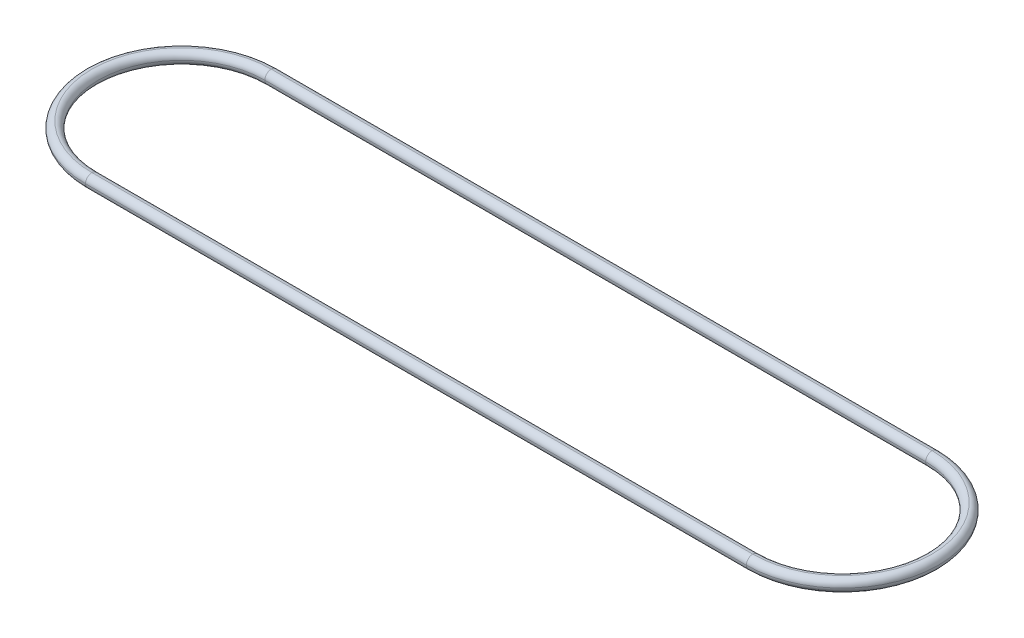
ISO-10303-21;
HEADER;
FILE_DESCRIPTION(('STEP AP214'),'2;1');
FILE_NAME('part.step','',(''),(''),'','','');
FILE_SCHEMA(('AUTOMOTIVE_DESIGN { 1 0 10303 214 1 1 1 1 }'));
ENDSEC;
DATA;
#1=APPLICATION_CONTEXT('core data for automotive mechanical design processes');
#2=APPLICATION_PROTOCOL_DEFINITION('international standard','automotive_design',2000,#1);
#3=PRODUCT_CONTEXT('',#1,'mechanical');
#4=PRODUCT('Part','Part','',(#3));
#5=PRODUCT_RELATED_PRODUCT_CATEGORY('part','',(#4));
#6=PRODUCT_DEFINITION_FORMATION('','',#4);
#7=PRODUCT_DEFINITION_CONTEXT('part definition',#1,'design');
#8=PRODUCT_DEFINITION('design','',#6,#7);
#9=PRODUCT_DEFINITION_SHAPE('','',#8);
#10=(LENGTH_UNIT() NAMED_UNIT(*) SI_UNIT(.MILLI.,.METRE.));
#11=(NAMED_UNIT(*) PLANE_ANGLE_UNIT() SI_UNIT($,.RADIAN.));
#12=(NAMED_UNIT(*) SI_UNIT($,.STERADIAN.) SOLID_ANGLE_UNIT());
#13=UNCERTAINTY_MEASURE_WITH_UNIT(LENGTH_MEASURE(1.E-05),#10,'distance_accuracy_value','');
#14=(GEOMETRIC_REPRESENTATION_CONTEXT(3) GLOBAL_UNCERTAINTY_ASSIGNED_CONTEXT((#13)) GLOBAL_UNIT_ASSIGNED_CONTEXT((#10,
#11,#12)) REPRESENTATION_CONTEXT('',''));
#15=CARTESIAN_POINT('',(0.,0.,0.));
#16=DIRECTION('',(0.,0.,1.));
#17=DIRECTION('',(1.,0.,0.));
#18=AXIS2_PLACEMENT_3D('',#15,#16,#17);
#19=CARTESIAN_POINT('',(0.,2.5,-35.));
#20=DIRECTION('',(1.,0.,0.));
#21=DIRECTION('',(0.,0.,-1.));
#22=AXIS2_PLACEMENT_3D('',#19,#20,#21);
#23=CYLINDRICAL_SURFACE('',#22,2.5);
#24=CARTESIAN_POINT('',(0.,2.5,-35.));
#25=DIRECTION('',(-1.,0.,0.));
#26=DIRECTION('',(0.,0.,1.));
#27=AXIS2_PLACEMENT_3D('',#24,#25,#26);
#28=CIRCLE('',#27,2.5);
#29=CARTESIAN_POINT('',(0.,5.,-35.));
#30=VERTEX_POINT('',#29);
#31=CARTESIAN_POINT('',(0.,2.5,-37.5));
#32=VERTEX_POINT('',#31);
#33=EDGE_CURVE('E11',#30,#32,#28,.T.);
#34=ORIENTED_EDGE('',*,*,#33,.F.);
#35=DIRECTION('',(-1.,0.,0.));
#36=VECTOR('',#35,1.);
#37=CARTESIAN_POINT('',(0.,5.,-35.));
#38=LINE('',#37,#36);
#39=CARTESIAN_POINT('',(258.,5.,-35.));
#40=VERTEX_POINT('',#39);
#41=EDGE_CURVE('E185',#40,#30,#38,.T.);
#42=ORIENTED_EDGE('',*,*,#41,.F.);
#43=CARTESIAN_POINT('',(258.,2.5,-35.));
#44=DIRECTION('',(1.,0.,0.));
#45=DIRECTION('',(0.,0.,-1.));
#46=AXIS2_PLACEMENT_3D('',#43,#44,#45);
#47=CIRCLE('',#46,2.5);
#48=CARTESIAN_POINT('',(258.,2.5,-37.5));
#49=VERTEX_POINT('',#48);
#50=EDGE_CURVE('E182',#49,#40,#47,.T.);
#51=ORIENTED_EDGE('',*,*,#50,.F.);
#52=DIRECTION('',(-1.,0.,0.));
#53=VECTOR('',#52,1.);
#54=CARTESIAN_POINT('',(258.,2.5,-37.5));
#55=LINE('',#54,#53);
#56=EDGE_CURVE('E34',#32,#49,#55,.F.);
#57=ORIENTED_EDGE('',*,*,#56,.F.);
#58=EDGE_LOOP('',(#34,#42,#51,#57));
#59=FACE_BOUND('',#58,.T.);
#60=ADVANCED_FACE('F27',(#59),#23,.T.);
#61=CARTESIAN_POINT('',(0.,2.5,0.));
#62=DIRECTION('',(0.,1.,0.));
#63=DIRECTION('',(0.,0.,1.));
#64=AXIS2_PLACEMENT_3D('',#61,#62,#63);
#65=TOROIDAL_SURFACE('',#64,35.,2.5);
#66=CARTESIAN_POINT('',(0.,5.,0.));
#67=DIRECTION('',(0.,1.,0.));
#68=DIRECTION('',(0.,0.,1.));
#69=AXIS2_PLACEMENT_3D('',#66,#67,#68);
#70=CIRCLE('',#69,35.);
#71=CARTESIAN_POINT('',(0.,5.,35.));
#72=VERTEX_POINT('',#71);
#73=EDGE_CURVE('E180',#30,#72,#70,.T.);
#74=ORIENTED_EDGE('',*,*,#73,.F.);
#75=ORIENTED_EDGE('',*,*,#33,.T.);
#76=CARTESIAN_POINT('',(0.,2.5,0.));
#77=DIRECTION('',(0.,1.,0.));
#78=DIRECTION('',(0.,0.,1.));
#79=AXIS2_PLACEMENT_3D('',#76,#77,#78);
#80=CIRCLE('',#79,37.5);
#81=CARTESIAN_POINT('',(0.,2.5,37.5));
#82=VERTEX_POINT('',#81);
#83=EDGE_CURVE('E172',#82,#32,#80,.F.);
#84=ORIENTED_EDGE('',*,*,#83,.F.);
#85=CARTESIAN_POINT('',(0.,2.5,35.));
#86=DIRECTION('',(1.,0.,0.));
#87=DIRECTION('',(0.,0.,-1.));
#88=AXIS2_PLACEMENT_3D('',#85,#86,#87);
#89=CIRCLE('',#88,2.5);
#90=EDGE_CURVE('E169',#72,#82,#89,.T.);
#91=ORIENTED_EDGE('',*,*,#90,.F.);
#92=EDGE_LOOP('',(#74,#75,#84,#91));
#93=FACE_BOUND('',#92,.T.);
#94=ADVANCED_FACE('F217',(#93),#65,.T.);
#95=CARTESIAN_POINT('',(0.,2.5,-35.));
#96=DIRECTION('',(-1.,0.,0.));
#97=DIRECTION('',(0.,0.,1.));
#98=AXIS2_PLACEMENT_3D('',#95,#96,#97);
#99=CYLINDRICAL_SURFACE('',#98,2.5);
#100=CARTESIAN_POINT('',(0.,2.5,-35.));
#101=DIRECTION('',(-1.,0.,0.));
#102=DIRECTION('',(0.,0.,1.));
#103=AXIS2_PLACEMENT_3D('',#100,#101,#102);
#104=CIRCLE('',#103,2.5);
#105=CARTESIAN_POINT('',(0.,0.,-35.));
#106=VERTEX_POINT('',#105);
#107=EDGE_CURVE('E175',#32,#106,#104,.T.);
#108=ORIENTED_EDGE('',*,*,#107,.F.);
#109=ORIENTED_EDGE('',*,*,#56,.T.);
#110=CARTESIAN_POINT('',(258.,2.5,-35.));
#111=DIRECTION('',(1.,0.,0.));
#112=DIRECTION('',(0.,0.,-1.));
#113=AXIS2_PLACEMENT_3D('',#110,#111,#112);
#114=CIRCLE('',#113,2.5);
#115=CARTESIAN_POINT('',(258.,0.,-35.));
#116=VERTEX_POINT('',#115);
#117=EDGE_CURVE('E164',#116,#49,#114,.T.);
#118=ORIENTED_EDGE('',*,*,#117,.F.);
#119=DIRECTION('',(-1.,0.,0.));
#120=VECTOR('',#119,1.);
#121=CARTESIAN_POINT('',(0.,0.,-35.));
#122=LINE('',#121,#120);
#123=EDGE_CURVE('E161',#106,#116,#122,.F.);
#124=ORIENTED_EDGE('',*,*,#123,.F.);
#125=EDGE_LOOP('',(#108,#109,#118,#124));
#126=FACE_BOUND('',#125,.T.);
#127=ADVANCED_FACE('F189',(#126),#99,.T.);
#128=CARTESIAN_POINT('',(0.,2.5,-35.));
#129=DIRECTION('',(-1.,0.,0.));
#130=DIRECTION('',(0.,0.,1.));
#131=AXIS2_PLACEMENT_3D('',#128,#129,#130);
#132=CYLINDRICAL_SURFACE('',#131,2.5);
#133=CARTESIAN_POINT('',(258.,2.5,-35.));
#134=DIRECTION('',(1.,0.,0.));
#135=DIRECTION('',(0.,0.,-1.));
#136=AXIS2_PLACEMENT_3D('',#133,#134,#135);
#137=CIRCLE('',#136,2.5);
#138=CARTESIAN_POINT('',(258.,2.5,-32.5));
#139=VERTEX_POINT('',#138);
#140=EDGE_CURVE('E155',#40,#139,#137,.T.);
#141=ORIENTED_EDGE('',*,*,#140,.F.);
#142=ORIENTED_EDGE('',*,*,#41,.T.);
#143=CARTESIAN_POINT('',(0.,2.5,-35.));
#144=DIRECTION('',(-1.,0.,0.));
#145=DIRECTION('',(0.,0.,1.));
#146=AXIS2_PLACEMENT_3D('',#143,#144,#145);
#147=CIRCLE('',#146,2.5);
#148=CARTESIAN_POINT('',(0.,2.5,-32.5));
#149=VERTEX_POINT('',#148);
#150=EDGE_CURVE('E177',#149,#30,#147,.T.);
#151=ORIENTED_EDGE('',*,*,#150,.F.);
#152=DIRECTION('',(-1.,0.,0.));
#153=VECTOR('',#152,1.);
#154=CARTESIAN_POINT('',(0.,2.5,-32.5));
#155=LINE('',#154,#153);
#156=EDGE_CURVE('E158',#139,#149,#155,.T.);
#157=ORIENTED_EDGE('',*,*,#156,.F.);
#158=EDGE_LOOP('',(#141,#142,#151,#157));
#159=FACE_BOUND('',#158,.T.);
#160=ADVANCED_FACE('F215',(#159),#132,.T.);
#161=CARTESIAN_POINT('',(258.,2.5,0.));
#162=DIRECTION('',(0.,1.,0.));
#163=DIRECTION('',(0.,0.,1.));
#164=AXIS2_PLACEMENT_3D('',#161,#162,#163);
#165=TOROIDAL_SURFACE('',#164,35.,2.5);
#166=CARTESIAN_POINT('',(258.,2.5,0.));
#167=DIRECTION('',(0.,1.,0.));
#168=DIRECTION('',(0.,0.,1.));
#169=AXIS2_PLACEMENT_3D('',#166,#167,#168);
#170=CIRCLE('',#169,37.5);
#171=CARTESIAN_POINT('',(258.,2.5,37.5));
#172=VERTEX_POINT('',#171);
#173=EDGE_CURVE('E95',#49,#172,#170,.F.);
#174=ORIENTED_EDGE('',*,*,#173,.F.);
#175=ORIENTED_EDGE('',*,*,#50,.T.);
#176=CARTESIAN_POINT('',(258.,5.,0.));
#177=DIRECTION('',(0.,1.,0.));
#178=DIRECTION('',(0.,0.,1.));
#179=AXIS2_PLACEMENT_3D('',#176,#177,#178);
#180=CIRCLE('',#179,35.);
#181=CARTESIAN_POINT('',(258.,5.,35.));
#182=VERTEX_POINT('',#181);
#183=EDGE_CURVE('E152',#182,#40,#180,.T.);
#184=ORIENTED_EDGE('',*,*,#183,.F.);
#185=CARTESIAN_POINT('',(258.,2.5,35.));
#186=DIRECTION('',(-1.,0.,0.));
#187=DIRECTION('',(0.,0.,1.));
#188=AXIS2_PLACEMENT_3D('',#185,#186,#187);
#189=CIRCLE('',#188,2.5);
#190=EDGE_CURVE('E167',#172,#182,#189,.T.);
#191=ORIENTED_EDGE('',*,*,#190,.F.);
#192=EDGE_LOOP('',(#174,#175,#184,#191));
#193=FACE_BOUND('',#192,.T.);
#194=ADVANCED_FACE('F194',(#193),#165,.T.);
#195=CARTESIAN_POINT('',(0.,2.5,0.));
#196=DIRECTION('',(0.,1.,0.));
#197=DIRECTION('',(0.,0.,1.));
#198=AXIS2_PLACEMENT_3D('',#195,#196,#197);
#199=TOROIDAL_SURFACE('',#198,35.,2.5);
#200=ORIENTED_EDGE('',*,*,#150,.T.);
#201=ORIENTED_EDGE('',*,*,#73,.T.);
#202=CARTESIAN_POINT('',(0.,2.5,35.));
#203=DIRECTION('',(1.,0.,0.));
#204=DIRECTION('',(0.,1.,0.));
#205=AXIS2_PLACEMENT_3D('',#202,#203,#204);
#206=CIRCLE('',#205,2.5);
#207=CARTESIAN_POINT('',(0.,2.5,32.5));
#208=VERTEX_POINT('',#207);
#209=EDGE_CURVE('E144',#208,#72,#206,.T.);
#210=ORIENTED_EDGE('',*,*,#209,.F.);
#211=CARTESIAN_POINT('',(0.,2.5,0.));
#212=DIRECTION('',(0.,1.,0.));
#213=DIRECTION('',(0.,0.,1.));
#214=AXIS2_PLACEMENT_3D('',#211,#212,#213);
#215=CIRCLE('',#214,32.5);
#216=EDGE_CURVE('E141',#149,#208,#215,.T.);
#217=ORIENTED_EDGE('',*,*,#216,.F.);
#218=EDGE_LOOP('',(#200,#201,#210,#217));
#219=FACE_BOUND('',#218,.T.);
#220=ADVANCED_FACE('F216',(#219),#199,.T.);
#221=CARTESIAN_POINT('',(0.,2.5,0.));
#222=DIRECTION('',(0.,1.,0.));
#223=DIRECTION('',(0.,0.,1.));
#224=AXIS2_PLACEMENT_3D('',#221,#222,#223);
#225=TOROIDAL_SURFACE('',#224,35.,2.5);
#226=ORIENTED_EDGE('',*,*,#83,.T.);
#227=ORIENTED_EDGE('',*,*,#107,.T.);
#228=CARTESIAN_POINT('',(0.,0.,0.));
#229=DIRECTION('',(0.,1.,0.));
#230=DIRECTION('',(0.,0.,1.));
#231=AXIS2_PLACEMENT_3D('',#228,#229,#230);
#232=CIRCLE('',#231,35.);
#233=CARTESIAN_POINT('',(0.,0.,35.));
#234=VERTEX_POINT('',#233);
#235=EDGE_CURVE('E135',#234,#106,#232,.F.);
#236=ORIENTED_EDGE('',*,*,#235,.F.);
#237=CARTESIAN_POINT('',(0.,2.5,35.));
#238=DIRECTION('',(1.,0.,0.));
#239=DIRECTION('',(0.,0.,-1.));
#240=AXIS2_PLACEMENT_3D('',#237,#238,#239);
#241=CIRCLE('',#240,2.5);
#242=EDGE_CURVE('E116',#82,#234,#241,.T.);
#243=ORIENTED_EDGE('',*,*,#242,.F.);
#244=EDGE_LOOP('',(#226,#227,#236,#243));
#245=FACE_BOUND('',#244,.T.);
#246=ADVANCED_FACE('F201',(#245),#225,.T.);
#247=CARTESIAN_POINT('',(0.,2.5,35.));
#248=DIRECTION('',(-1.,0.,0.));
#249=DIRECTION('',(0.,0.,1.));
#250=AXIS2_PLACEMENT_3D('',#247,#248,#249);
#251=CYLINDRICAL_SURFACE('',#250,2.5);
#252=DIRECTION('',(1.,0.,0.));
#253=VECTOR('',#252,1.);
#254=CARTESIAN_POINT('',(258.,5.,35.));
#255=LINE('',#254,#253);
#256=EDGE_CURVE('E147',#72,#182,#255,.T.);
#257=ORIENTED_EDGE('',*,*,#256,.F.);
#258=ORIENTED_EDGE('',*,*,#90,.T.);
#259=DIRECTION('',(1.,0.,0.));
#260=VECTOR('',#259,1.);
#261=CARTESIAN_POINT('',(0.,2.5,37.5));
#262=LINE('',#261,#260);
#263=EDGE_CURVE('E100',#172,#82,#262,.F.);
#264=ORIENTED_EDGE('',*,*,#263,.F.);
#265=ORIENTED_EDGE('',*,*,#190,.T.);
#266=EDGE_LOOP('',(#257,#258,#264,#265));
#267=FACE_BOUND('',#266,.T.);
#268=ADVANCED_FACE('F198',(#267),#251,.T.);
#269=CARTESIAN_POINT('',(258.,2.5,0.));
#270=DIRECTION('',(0.,1.,0.));
#271=DIRECTION('',(0.,0.,1.));
#272=AXIS2_PLACEMENT_3D('',#269,#270,#271);
#273=TOROIDAL_SURFACE('',#272,35.,2.5);
#274=ORIENTED_EDGE('',*,*,#117,.T.);
#275=ORIENTED_EDGE('',*,*,#173,.T.);
#276=CARTESIAN_POINT('',(258.,2.5,35.));
#277=DIRECTION('',(-1.,0.,0.));
#278=DIRECTION('',(0.,0.,1.));
#279=AXIS2_PLACEMENT_3D('',#276,#277,#278);
#280=CIRCLE('',#279,2.5);
#281=CARTESIAN_POINT('',(258.,0.,35.));
#282=VERTEX_POINT('',#281);
#283=EDGE_CURVE('E88',#282,#172,#280,.T.);
#284=ORIENTED_EDGE('',*,*,#283,.F.);
#285=CARTESIAN_POINT('',(258.,0.,0.));
#286=DIRECTION('',(0.,1.,0.));
#287=DIRECTION('',(0.,0.,1.));
#288=AXIS2_PLACEMENT_3D('',#285,#286,#287);
#289=CIRCLE('',#288,35.);
#290=EDGE_CURVE('E92',#116,#282,#289,.F.);
#291=ORIENTED_EDGE('',*,*,#290,.F.);
#292=EDGE_LOOP('',(#274,#275,#284,#291));
#293=FACE_BOUND('',#292,.T.);
#294=ADVANCED_FACE('F91',(#293),#273,.T.);
#295=CARTESIAN_POINT('',(0.,2.5,-35.));
#296=DIRECTION('',(1.,0.,0.));
#297=DIRECTION('',(0.,0.,-1.));
#298=AXIS2_PLACEMENT_3D('',#295,#296,#297);
#299=CYLINDRICAL_SURFACE('',#298,2.5);
#300=CARTESIAN_POINT('',(258.,2.5,-35.));
#301=DIRECTION('',(1.,0.,0.));
#302=DIRECTION('',(0.,0.,-1.));
#303=AXIS2_PLACEMENT_3D('',#300,#301,#302);
#304=CIRCLE('',#303,2.5);
#305=EDGE_CURVE('E109',#139,#116,#304,.T.);
#306=ORIENTED_EDGE('',*,*,#305,.F.);
#307=ORIENTED_EDGE('',*,*,#156,.T.);
#308=CARTESIAN_POINT('',(0.,2.5,-35.));
#309=DIRECTION('',(-1.,0.,0.));
#310=DIRECTION('',(0.,0.,1.));
#311=AXIS2_PLACEMENT_3D('',#308,#309,#310);
#312=CIRCLE('',#311,2.5);
#313=EDGE_CURVE('E138',#106,#149,#312,.T.);
#314=ORIENTED_EDGE('',*,*,#313,.F.);
#315=ORIENTED_EDGE('',*,*,#123,.T.);
#316=EDGE_LOOP('',(#306,#307,#314,#315));
#317=FACE_BOUND('',#316,.T.);
#318=ADVANCED_FACE('F214',(#317),#299,.T.);
#319=CARTESIAN_POINT('',(258.,2.5,0.));
#320=DIRECTION('',(0.,1.,0.));
#321=DIRECTION('',(0.,0.,1.));
#322=AXIS2_PLACEMENT_3D('',#319,#320,#321);
#323=TOROIDAL_SURFACE('',#322,35.,2.5);
#324=CARTESIAN_POINT('',(258.,2.5,35.));
#325=DIRECTION('',(-1.,0.,0.));
#326=DIRECTION('',(0.,0.,1.));
#327=AXIS2_PLACEMENT_3D('',#324,#325,#326);
#328=CIRCLE('',#327,2.5);
#329=CARTESIAN_POINT('',(258.,2.5,32.5));
#330=VERTEX_POINT('',#329);
#331=EDGE_CURVE('E150',#182,#330,#328,.T.);
#332=ORIENTED_EDGE('',*,*,#331,.F.);
#333=ORIENTED_EDGE('',*,*,#183,.T.);
#334=ORIENTED_EDGE('',*,*,#140,.T.);
#335=CARTESIAN_POINT('',(258.,2.5,0.));
#336=DIRECTION('',(0.,1.,0.));
#337=DIRECTION('',(0.,0.,1.));
#338=AXIS2_PLACEMENT_3D('',#335,#336,#337);
#339=CIRCLE('',#338,32.5);
#340=EDGE_CURVE('E130',#330,#139,#339,.T.);
#341=ORIENTED_EDGE('',*,*,#340,.F.);
#342=EDGE_LOOP('',(#332,#333,#334,#341));
#343=FACE_BOUND('',#342,.T.);
#344=ADVANCED_FACE('F211',(#343),#323,.T.);
#345=CARTESIAN_POINT('',(258.,2.5,35.));
#346=DIRECTION('',(1.,0.,0.));
#347=DIRECTION('',(0.,0.,-1.));
#348=AXIS2_PLACEMENT_3D('',#345,#346,#347);
#349=CYLINDRICAL_SURFACE('',#348,2.5);
#350=ORIENTED_EDGE('',*,*,#256,.T.);
#351=ORIENTED_EDGE('',*,*,#331,.T.);
#352=DIRECTION('',(1.,0.,0.));
#353=VECTOR('',#352,1.);
#354=CARTESIAN_POINT('',(258.,2.5,32.5));
#355=LINE('',#354,#353);
#356=EDGE_CURVE('E125',#208,#330,#355,.T.);
#357=ORIENTED_EDGE('',*,*,#356,.F.);
#358=ORIENTED_EDGE('',*,*,#209,.T.);
#359=EDGE_LOOP('',(#350,#351,#357,#358));
#360=FACE_BOUND('',#359,.T.);
#361=ADVANCED_FACE('F208',(#360),#349,.T.);
#362=CARTESIAN_POINT('',(0.,2.5,0.));
#363=DIRECTION('',(0.,1.,0.));
#364=DIRECTION('',(0.,0.,1.));
#365=AXIS2_PLACEMENT_3D('',#362,#363,#364);
#366=TOROIDAL_SURFACE('',#365,35.,2.5);
#367=ORIENTED_EDGE('',*,*,#313,.T.);
#368=ORIENTED_EDGE('',*,*,#216,.T.);
#369=CARTESIAN_POINT('',(0.,2.5,35.));
#370=DIRECTION('',(1.,0.,0.));
#371=DIRECTION('',(0.,0.,-1.));
#372=AXIS2_PLACEMENT_3D('',#369,#370,#371);
#373=CIRCLE('',#372,2.5);
#374=EDGE_CURVE('E120',#234,#208,#373,.T.);
#375=ORIENTED_EDGE('',*,*,#374,.F.);
#376=ORIENTED_EDGE('',*,*,#235,.T.);
#377=EDGE_LOOP('',(#367,#368,#375,#376));
#378=FACE_BOUND('',#377,.T.);
#379=ADVANCED_FACE('F203',(#378),#366,.T.);
#380=CARTESIAN_POINT('',(0.,2.5,35.));
#381=DIRECTION('',(1.,0.,0.));
#382=DIRECTION('',(0.,0.,-1.));
#383=AXIS2_PLACEMENT_3D('',#380,#381,#382);
#384=CYLINDRICAL_SURFACE('',#383,2.5);
#385=ORIENTED_EDGE('',*,*,#263,.T.);
#386=ORIENTED_EDGE('',*,*,#242,.T.);
#387=DIRECTION('',(1.,0.,0.));
#388=VECTOR('',#387,1.);
#389=CARTESIAN_POINT('',(0.,0.,35.));
#390=LINE('',#389,#388);
#391=EDGE_CURVE('E113',#282,#234,#390,.F.);
#392=ORIENTED_EDGE('',*,*,#391,.F.);
#393=ORIENTED_EDGE('',*,*,#283,.T.);
#394=EDGE_LOOP('',(#385,#386,#392,#393));
#395=FACE_BOUND('',#394,.T.);
#396=ADVANCED_FACE('F114',(#395),#384,.T.);
#397=CARTESIAN_POINT('',(258.,2.5,0.));
#398=DIRECTION('',(0.,1.,0.));
#399=DIRECTION('',(0.,0.,1.));
#400=AXIS2_PLACEMENT_3D('',#397,#398,#399);
#401=TOROIDAL_SURFACE('',#400,35.,2.5);
#402=ORIENTED_EDGE('',*,*,#305,.T.);
#403=ORIENTED_EDGE('',*,*,#290,.T.);
#404=CARTESIAN_POINT('',(258.,2.5,35.));
#405=DIRECTION('',(-1.,0.,0.));
#406=DIRECTION('',(0.,0.,1.));
#407=AXIS2_PLACEMENT_3D('',#404,#405,#406);
#408=CIRCLE('',#407,2.5);
#409=EDGE_CURVE('E107',#330,#282,#408,.T.);
#410=ORIENTED_EDGE('',*,*,#409,.F.);
#411=ORIENTED_EDGE('',*,*,#340,.T.);
#412=EDGE_LOOP('',(#402,#403,#410,#411));
#413=FACE_BOUND('',#412,.T.);
#414=ADVANCED_FACE('F104',(#413),#401,.T.);
#415=CARTESIAN_POINT('',(0.,2.5,35.));
#416=DIRECTION('',(-1.,0.,0.));
#417=DIRECTION('',(0.,0.,1.));
#418=AXIS2_PLACEMENT_3D('',#415,#416,#417);
#419=CYLINDRICAL_SURFACE('',#418,2.5);
#420=ORIENTED_EDGE('',*,*,#374,.T.);
#421=ORIENTED_EDGE('',*,*,#356,.T.);
#422=ORIENTED_EDGE('',*,*,#409,.T.);
#423=ORIENTED_EDGE('',*,*,#391,.T.);
#424=EDGE_LOOP('',(#420,#421,#422,#423));
#425=FACE_BOUND('',#424,.T.);
#426=ADVANCED_FACE('F123',(#425),#419,.T.);
#427=CLOSED_SHELL('',(#60,#94,#127,#160,#194,#220,#246,#268,#294,#318,#344,#361,#379,#396,#414,#426));
#428=MANIFOLD_SOLID_BREP('B2',#427);
#429=ADVANCED_BREP_SHAPE_REPRESENTATION('',(#18,#428),#14);
#430=SHAPE_DEFINITION_REPRESENTATION(#9,#429);
ENDSEC;
END-ISO-10303-21;
